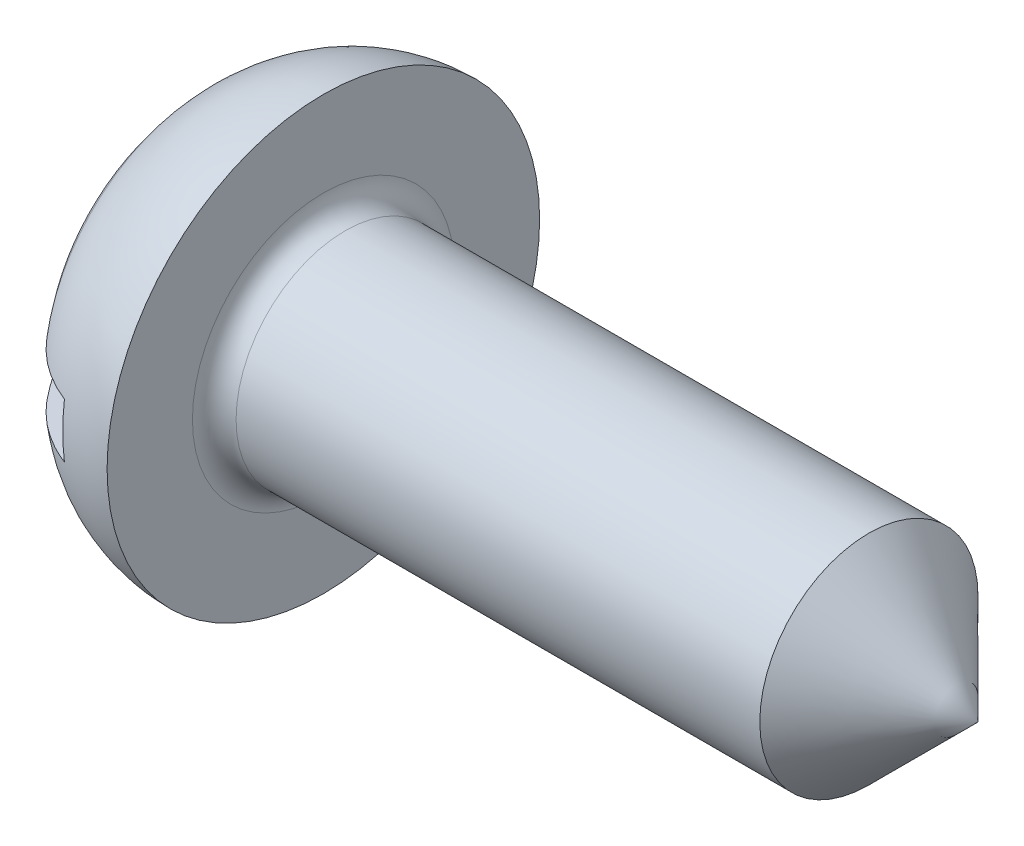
from build123d import *

# Parameters (mm, degrees)
SKETCH1_R       = 1
BASEBODY_DEPTH  = 6
SLOT_DEPTH      = 8.418156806
SLOT_DEPTH_BACK = 8.418156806
SKETCH3_W       = 0.5
SKETCH3_H       = 1.1
FILLET1_R       = 0.2


with BuildPart() as part:
    # Sketch2 → BaseHead (revolve)
    with BuildSketch(Plane(origin=(2.389236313, 0, -0.407091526), x_dir=(0, 0, -1), z_dir=(0, 1, 0))):
        with BuildLine():
            Line((-0.407091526, 0.789236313), (-0.407091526, 1.289236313))
            Line((-0.407091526, 1.289236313), (-0.157091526, 1.289236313))
            Line((-0.157091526, 1.289236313), (-0.157091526, 2.389236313))
            ThreePointArc((-0.157091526, 2.389236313), (0.501611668, 2.215742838), (1.08061182, 1.856927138))
            ThreePointArc((1.08061182, 1.856927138), (1.445443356, 1.377546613), (1.575053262, 0.789236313))
            Line((1.575053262, 0.789236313), (-0.407091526, 0.789236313))
        make_face()
    revolve(axis=Axis((3.397247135, 0, 0), (-1, 0, 0)))

    # Sketch1 → BaseBody (add)
    with BuildSketch(Plane(origin=(1.6, 0.592295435, -0.173354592), x_dir=(0, 0, -1), z_dir=(1, 0, 0))):
        with Locations((-0.173354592, -0.592295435)):
            Circle(SKETCH1_R)
    extrude(amount=BASEBODY_DEPTH)

    # Sketch3 → Slot (cut, two sides: drawn at the far end of the back side and taken through both)
    with BuildSketch(Plane(origin=(1.197809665, 1.197809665, 0), x_dir=(0, 1, 0), z_dir=(0, 0, 1)).offset(-SLOT_DEPTH_BACK)):
        with Locations((-1.197809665, 0.647809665)):
            Rectangle(SKETCH3_W, SKETCH3_H)
    extrude(amount=SLOT_DEPTH + SLOT_DEPTH_BACK, mode=Mode.SUBTRACT)

    # Sketch4 → Cut-Revolve1 (revolve, cut)
    with BuildSketch(Plane(origin=(23.263333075, -6.736666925, 0), x_dir=(0, 1, 0), z_dir=(0, 0, 1)), mode=Mode.PRIVATE) as cut_revolve1_sk:
        Polygon((8.736666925, 14.663333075), (8.736666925, 17.663333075), (6.736666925, 15.663333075), (6.736666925, 14.663333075), align=None)
    revolve(cut_revolve1_sk.sketch.rotate(Axis((5.634860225, 0, 0), (1, 0, 0)), 90), axis=Axis((5.634860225, 0, 0), (1, 0, 0)), mode=Mode.SUBTRACT)

    # Fillet1
    fillet1_edges = [part.edges().sort_by_distance(p)[0] for p in [
        (1.6, 0, 1),
    ]]
    fillet(fillet1_edges, radius=FILLET1_R)


solid = part.part
